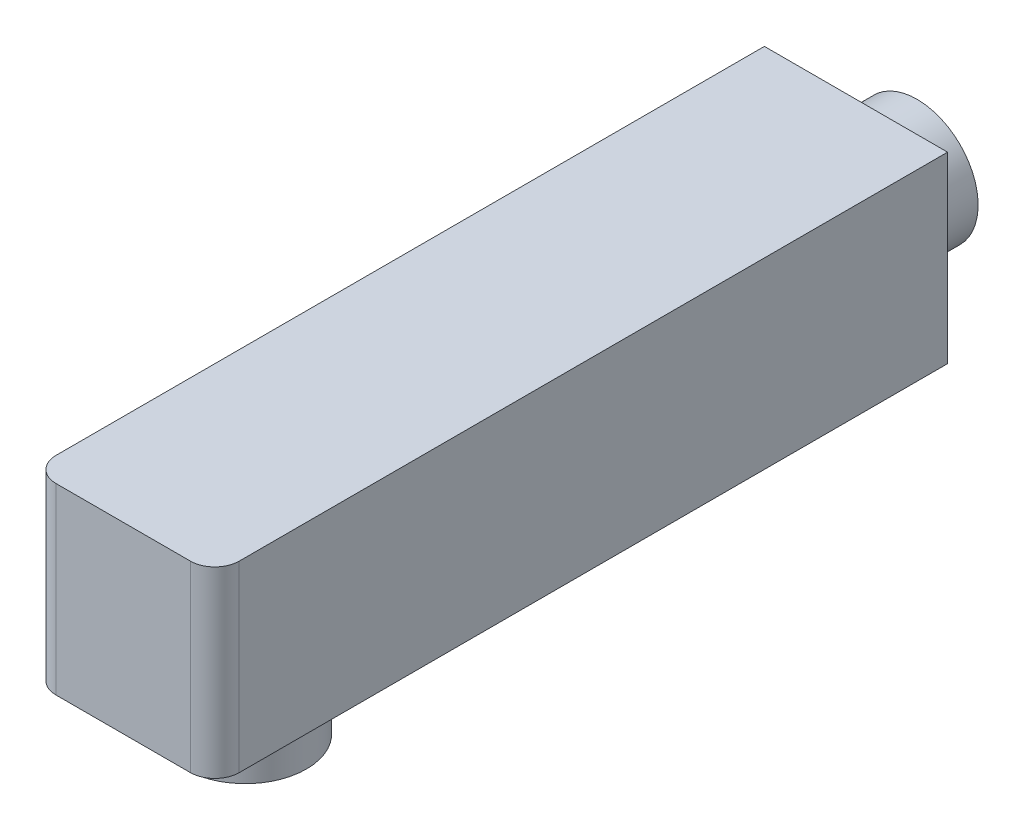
from build123d import *

# Parameters (mm, degrees)
SKETCH_1_W      = 150
SKETCH_1_H      = 150
EXTRUDE_1_DEPTH = 600
SKETCH_2_R      = 50
EXTRUDE_2_DEPTH = 50
SKETCH_3_R      = 50
EXTRUDE_3_DEPTH = 50
FILLET_1_R      = 20


with BuildPart() as part:
    # Sketch 1 → Extrude 1 (new body)
    with BuildSketch(Plane.XY):
        with Locations((75, 75)):
            Rectangle(SKETCH_1_W, SKETCH_1_H)
    extrude(amount=EXTRUDE_1_DEPTH)

    # Sketch 2 → Extrude 2 (add)
    with BuildSketch(Plane(origin=(0, 0, 0), x_dir=(-1, 0, 0), z_dir=(0, 0, -1))):
        with Locations((-75, 75)):
            Circle(SKETCH_2_R)
    extrude(amount=EXTRUDE_2_DEPTH)

    # Sketch 3 → Extrude 3 (add)
    with BuildSketch(Plane.XZ):
        with Locations(Location((75, 500, 0), (0, 0, 90))):
            Circle(SKETCH_3_R)
    extrude(amount=EXTRUDE_3_DEPTH)

    # Fillet 1
    fillet_1_edges = [part.edges().sort_by_distance(p)[0] for p in [
        (150, 75, 600),
        (0, 75, 600),
    ]]
    fillet(fillet_1_edges, radius=FILLET_1_R)


solid = part.part
